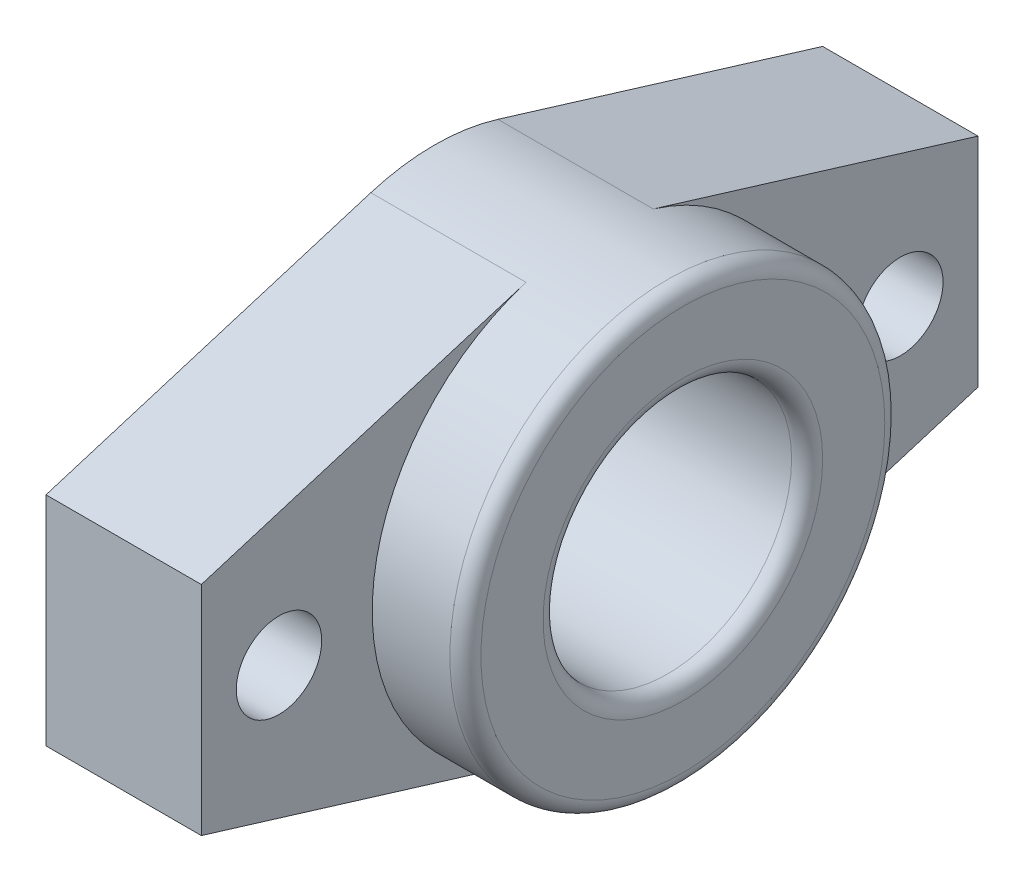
ISO-10303-21;
HEADER;
FILE_DESCRIPTION(('STEP AP214'),'2;1');
FILE_NAME('part.step','',(''),(''),'','','');
FILE_SCHEMA(('AUTOMOTIVE_DESIGN { 1 0 10303 214 1 1 1 1 }'));
ENDSEC;
DATA;
#1=APPLICATION_CONTEXT('core data for automotive mechanical design processes');
#2=APPLICATION_PROTOCOL_DEFINITION('international standard','automotive_design',2000,#1);
#3=PRODUCT_CONTEXT('',#1,'mechanical');
#4=PRODUCT('Part','Part','',(#3));
#5=PRODUCT_RELATED_PRODUCT_CATEGORY('part','',(#4));
#6=PRODUCT_DEFINITION_FORMATION('','',#4);
#7=PRODUCT_DEFINITION_CONTEXT('part definition',#1,'design');
#8=PRODUCT_DEFINITION('design','',#6,#7);
#9=PRODUCT_DEFINITION_SHAPE('','',#8);
#10=(LENGTH_UNIT() NAMED_UNIT(*) SI_UNIT(.MILLI.,.METRE.));
#11=(NAMED_UNIT(*) PLANE_ANGLE_UNIT() SI_UNIT($,.RADIAN.));
#12=(NAMED_UNIT(*) SI_UNIT($,.STERADIAN.) SOLID_ANGLE_UNIT());
#13=UNCERTAINTY_MEASURE_WITH_UNIT(LENGTH_MEASURE(1.E-05),#10,'distance_accuracy_value','');
#14=(GEOMETRIC_REPRESENTATION_CONTEXT(3) GLOBAL_UNCERTAINTY_ASSIGNED_CONTEXT((#13)) GLOBAL_UNIT_ASSIGNED_CONTEXT((#10,
#11,#12)) REPRESENTATION_CONTEXT('',''));
#15=CARTESIAN_POINT('',(0.,0.,0.));
#16=DIRECTION('',(0.,0.,1.));
#17=DIRECTION('',(1.,0.,0.));
#18=AXIS2_PLACEMENT_3D('',#15,#16,#17);
#19=CARTESIAN_POINT('',(10.,14.,-25.));
#20=DIRECTION('',(1.,0.,0.));
#21=DIRECTION('',(0.,0.,-1.));
#22=AXIS2_PLACEMENT_3D('',#19,#20,#21);
#23=PLANE('',#22);
#24=CARTESIAN_POINT('',(10.,14.,-5.));
#25=DIRECTION('',(1.,0.,0.));
#26=DIRECTION('',(0.,0.,-1.));
#27=AXIS2_PLACEMENT_3D('',#24,#25,#26);
#28=CIRCLE('',#27,2.75);
#29=CARTESIAN_POINT('',(10.,14.,-7.75));
#30=VERTEX_POINT('',#29);
#31=EDGE_CURVE('E260',#30,#30,#28,.T.);
#32=ORIENTED_EDGE('',*,*,#31,.F.);
#33=EDGE_LOOP('',(#32));
#34=FACE_BOUND('',#33,.T.);
#35=CARTESIAN_POINT('',(10.,14.,-25.));
#36=DIRECTION('',(1.,0.,0.));
#37=DIRECTION('',(0.,0.,-1.));
#38=AXIS2_PLACEMENT_3D('',#35,#36,#37);
#39=CIRCLE('',#38,14.);
#40=CARTESIAN_POINT('',(10.,27.3889078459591,-20.9088941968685));
#41=VERTEX_POINT('',#40);
#42=CARTESIAN_POINT('',(10.,0.61109215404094,-20.9088941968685));
#43=VERTEX_POINT('',#42);
#44=EDGE_CURVE('E63',#41,#43,#39,.T.);
#45=ORIENTED_EDGE('',*,*,#44,.F.);
#46=DIRECTION('',(0.,-0.292221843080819,0.956350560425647));
#47=VECTOR('',#46,1.);
#48=CARTESIAN_POINT('',(10.,21.,0.));
#49=LINE('',#48,#47);
#50=CARTESIAN_POINT('',(10.,21.,0.));
#51=VERTEX_POINT('',#50);
#52=EDGE_CURVE('E179',#41,#51,#49,.T.);
#53=ORIENTED_EDGE('',*,*,#52,.T.);
#54=DIRECTION('',(0.,-1.,0.));
#55=VECTOR('',#54,1.);
#56=CARTESIAN_POINT('',(10.,7.,0.));
#57=LINE('',#56,#55);
#58=CARTESIAN_POINT('',(10.,7.,0.));
#59=VERTEX_POINT('',#58);
#60=EDGE_CURVE('E109',#51,#59,#57,.T.);
#61=ORIENTED_EDGE('',*,*,#60,.T.);
#62=DIRECTION('',(0.,-0.292221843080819,-0.956350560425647));
#63=VECTOR('',#62,1.);
#64=CARTESIAN_POINT('',(10.,7.,0.));
#65=LINE('',#64,#63);
#66=EDGE_CURVE('E133',#59,#43,#65,.T.);
#67=ORIENTED_EDGE('',*,*,#66,.T.);
#68=EDGE_LOOP('',(#45,#53,#61,#67));
#69=FACE_BOUND('',#68,.T.);
#70=ADVANCED_FACE('F45',(#34,#69),#23,.T.);
#71=CARTESIAN_POINT('',(10.,21.,0.));
#72=DIRECTION('',(0.,-0.956350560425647,-0.292221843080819));
#73=DIRECTION('',(0.,0.292221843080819,-0.956350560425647));
#74=AXIS2_PLACEMENT_3D('',#71,#72,#73);
#75=PLANE('',#74);
#76=DIRECTION('',(0.,-0.292221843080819,0.956350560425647));
#77=VECTOR('',#76,1.);
#78=CARTESIAN_POINT('',(0.,21.,0.));
#79=LINE('',#78,#77);
#80=CARTESIAN_POINT('',(0.,27.3889078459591,-20.9088941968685));
#81=VERTEX_POINT('',#80);
#82=CARTESIAN_POINT('',(0.,21.,0.));
#83=VERTEX_POINT('',#82);
#84=EDGE_CURVE('E156',#81,#83,#79,.T.);
#85=ORIENTED_EDGE('',*,*,#84,.T.);
#86=DIRECTION('',(-1.,0.,0.));
#87=VECTOR('',#86,1.);
#88=CARTESIAN_POINT('',(10.,21.,0.));
#89=LINE('',#88,#87);
#90=EDGE_CURVE('E197',#51,#83,#89,.T.);
#91=ORIENTED_EDGE('',*,*,#90,.F.);
#92=ORIENTED_EDGE('',*,*,#52,.F.);
#93=DIRECTION('',(-1.,0.,0.));
#94=VECTOR('',#93,1.);
#95=CARTESIAN_POINT('',(10.,27.3889078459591,-20.9088941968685));
#96=LINE('',#95,#94);
#97=EDGE_CURVE('E152',#41,#81,#96,.T.);
#98=ORIENTED_EDGE('',*,*,#97,.T.);
#99=EDGE_LOOP('',(#85,#91,#92,#98));
#100=FACE_BOUND('',#99,.T.);
#101=ADVANCED_FACE('F233',(#100),#75,.F.);
#102=CARTESIAN_POINT('',(10.,7.,0.));
#103=DIRECTION('',(0.,0.,-1.));
#104=DIRECTION('',(-1.,0.,0.));
#105=AXIS2_PLACEMENT_3D('',#102,#103,#104);
#106=PLANE('',#105);
#107=DIRECTION('',(0.,-1.,0.));
#108=VECTOR('',#107,1.);
#109=CARTESIAN_POINT('',(0.,7.,0.));
#110=LINE('',#109,#108);
#111=CARTESIAN_POINT('',(0.,7.,0.));
#112=VERTEX_POINT('',#111);
#113=EDGE_CURVE('E160',#83,#112,#110,.T.);
#114=ORIENTED_EDGE('',*,*,#113,.T.);
#115=DIRECTION('',(-1.,0.,0.));
#116=VECTOR('',#115,1.);
#117=CARTESIAN_POINT('',(10.,7.,0.));
#118=LINE('',#117,#116);
#119=EDGE_CURVE('E193',#59,#112,#118,.T.);
#120=ORIENTED_EDGE('',*,*,#119,.F.);
#121=ORIENTED_EDGE('',*,*,#60,.F.);
#122=ORIENTED_EDGE('',*,*,#90,.T.);
#123=EDGE_LOOP('',(#114,#120,#121,#122));
#124=FACE_BOUND('',#123,.T.);
#125=ADVANCED_FACE('F241',(#124),#106,.F.);
#126=CARTESIAN_POINT('',(10.,7.,0.));
#127=DIRECTION('',(0.,0.956350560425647,-0.292221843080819));
#128=DIRECTION('',(0.,0.292221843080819,0.956350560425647));
#129=AXIS2_PLACEMENT_3D('',#126,#127,#128);
#130=PLANE('',#129);
#131=DIRECTION('',(0.,-0.292221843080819,-0.956350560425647));
#132=VECTOR('',#131,1.);
#133=CARTESIAN_POINT('',(0.,7.,0.));
#134=LINE('',#133,#132);
#135=CARTESIAN_POINT('',(0.,0.61109215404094,-20.9088941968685));
#136=VERTEX_POINT('',#135);
#137=EDGE_CURVE('E164',#112,#136,#134,.T.);
#138=ORIENTED_EDGE('',*,*,#137,.T.);
#139=DIRECTION('',(-1.,0.,0.));
#140=VECTOR('',#139,1.);
#141=CARTESIAN_POINT('',(10.,0.61109215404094,-20.9088941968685));
#142=LINE('',#141,#140);
#143=EDGE_CURVE('E189',#43,#136,#142,.T.);
#144=ORIENTED_EDGE('',*,*,#143,.F.);
#145=ORIENTED_EDGE('',*,*,#66,.F.);
#146=ORIENTED_EDGE('',*,*,#119,.T.);
#147=EDGE_LOOP('',(#138,#144,#145,#146));
#148=FACE_BOUND('',#147,.T.);
#149=ADVANCED_FACE('F277',(#148),#130,.F.);
#150=CARTESIAN_POINT('',(10.,7.,-50.));
#151=DIRECTION('',(0.,0.956350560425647,0.292221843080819));
#152=DIRECTION('',(0.,-0.292221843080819,0.956350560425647));
#153=AXIS2_PLACEMENT_3D('',#150,#151,#152);
#154=PLANE('',#153);
#155=DIRECTION('',(0.,0.292221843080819,-0.956350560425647));
#156=VECTOR('',#155,1.);
#157=CARTESIAN_POINT('',(0.,7.,-50.));
#158=LINE('',#157,#156);
#159=CARTESIAN_POINT('',(0.,0.611092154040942,-29.0911058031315));
#160=VERTEX_POINT('',#159);
#161=CARTESIAN_POINT('',(0.,7.,-50.));
#162=VERTEX_POINT('',#161);
#163=EDGE_CURVE('E139',#160,#162,#158,.T.);
#164=ORIENTED_EDGE('',*,*,#163,.T.);
#165=DIRECTION('',(-1.,0.,0.));
#166=VECTOR('',#165,1.);
#167=CARTESIAN_POINT('',(10.,7.,-50.));
#168=LINE('',#167,#166);
#169=CARTESIAN_POINT('',(10.,7.,-50.));
#170=VERTEX_POINT('',#169);
#171=EDGE_CURVE('E136',#170,#162,#168,.T.);
#172=ORIENTED_EDGE('',*,*,#171,.F.);
#173=DIRECTION('',(0.,0.292221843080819,-0.956350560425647));
#174=VECTOR('',#173,1.);
#175=CARTESIAN_POINT('',(10.,7.,-50.));
#176=LINE('',#175,#174);
#177=CARTESIAN_POINT('',(10.,0.611092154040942,-29.0911058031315));
#178=VERTEX_POINT('',#177);
#179=EDGE_CURVE('E120',#178,#170,#176,.T.);
#180=ORIENTED_EDGE('',*,*,#179,.F.);
#181=DIRECTION('',(-1.,0.,0.));
#182=VECTOR('',#181,1.);
#183=CARTESIAN_POINT('',(10.,0.611092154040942,-29.0911058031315));
#184=LINE('',#183,#182);
#185=EDGE_CURVE('E143',#178,#160,#184,.T.);
#186=ORIENTED_EDGE('',*,*,#185,.T.);
#187=EDGE_LOOP('',(#164,#172,#180,#186));
#188=FACE_BOUND('',#187,.T.);
#189=ADVANCED_FACE('F137',(#188),#154,.F.);
#190=CARTESIAN_POINT('',(10.,7.,-50.));
#191=DIRECTION('',(0.,0.,1.));
#192=DIRECTION('',(1.,0.,0.));
#193=AXIS2_PLACEMENT_3D('',#190,#191,#192);
#194=PLANE('',#193);
#195=DIRECTION('',(0.,1.,0.));
#196=VECTOR('',#195,1.);
#197=CARTESIAN_POINT('',(0.,7.,-50.));
#198=LINE('',#197,#196);
#199=CARTESIAN_POINT('',(0.,21.,-50.));
#200=VERTEX_POINT('',#199);
#201=EDGE_CURVE('E172',#162,#200,#198,.T.);
#202=ORIENTED_EDGE('',*,*,#201,.T.);
#203=DIRECTION('',(-1.,0.,0.));
#204=VECTOR('',#203,1.);
#205=CARTESIAN_POINT('',(10.,21.,-50.));
#206=LINE('',#205,#204);
#207=CARTESIAN_POINT('',(10.,21.,-50.));
#208=VERTEX_POINT('',#207);
#209=EDGE_CURVE('E144',#208,#200,#206,.T.);
#210=ORIENTED_EDGE('',*,*,#209,.F.);
#211=DIRECTION('',(0.,1.,0.));
#212=VECTOR('',#211,1.);
#213=CARTESIAN_POINT('',(10.,7.,-50.));
#214=LINE('',#213,#212);
#215=EDGE_CURVE('E125',#170,#208,#214,.T.);
#216=ORIENTED_EDGE('',*,*,#215,.F.);
#217=ORIENTED_EDGE('',*,*,#171,.T.);
#218=EDGE_LOOP('',(#202,#210,#216,#217));
#219=FACE_BOUND('',#218,.T.);
#220=ADVANCED_FACE('F146',(#219),#194,.F.);
#221=CARTESIAN_POINT('',(10.,21.,-50.));
#222=DIRECTION('',(0.,-0.956350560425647,0.292221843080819));
#223=DIRECTION('',(0.,-0.292221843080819,-0.956350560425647));
#224=AXIS2_PLACEMENT_3D('',#221,#222,#223);
#225=PLANE('',#224);
#226=DIRECTION('',(0.,0.292221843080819,0.956350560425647));
#227=VECTOR('',#226,1.);
#228=CARTESIAN_POINT('',(0.,21.,-50.));
#229=LINE('',#228,#227);
#230=CARTESIAN_POINT('',(0.,27.3889078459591,-29.0911058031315));
#231=VERTEX_POINT('',#230);
#232=EDGE_CURVE('E94',#200,#231,#229,.T.);
#233=ORIENTED_EDGE('',*,*,#232,.T.);
#234=DIRECTION('',(-1.,0.,0.));
#235=VECTOR('',#234,1.);
#236=CARTESIAN_POINT('',(10.,27.3889078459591,-29.0911058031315));
#237=LINE('',#236,#235);
#238=CARTESIAN_POINT('',(10.,27.3889078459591,-29.0911058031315));
#239=VERTEX_POINT('',#238);
#240=EDGE_CURVE('E182',#239,#231,#237,.T.);
#241=ORIENTED_EDGE('',*,*,#240,.F.);
#242=DIRECTION('',(0.,0.292221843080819,0.956350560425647));
#243=VECTOR('',#242,1.);
#244=CARTESIAN_POINT('',(10.,21.,-50.));
#245=LINE('',#244,#243);
#246=EDGE_CURVE('E149',#208,#239,#245,.T.);
#247=ORIENTED_EDGE('',*,*,#246,.F.);
#248=ORIENTED_EDGE('',*,*,#209,.T.);
#249=EDGE_LOOP('',(#233,#241,#247,#248));
#250=FACE_BOUND('',#249,.T.);
#251=ADVANCED_FACE('F253',(#250),#225,.F.);
#252=CARTESIAN_POINT('',(10.,14.,-25.));
#253=DIRECTION('',(-1.,0.,0.));
#254=DIRECTION('',(0.,0.,1.));
#255=AXIS2_PLACEMENT_3D('',#252,#253,#254);
#256=CYLINDRICAL_SURFACE('',#255,14.);
#257=CARTESIAN_POINT('',(15.,14.,-25.));
#258=DIRECTION('',(1.,0.,0.));
#259=DIRECTION('',(0.,0.,-1.));
#260=AXIS2_PLACEMENT_3D('',#257,#258,#259);
#261=CIRCLE('',#260,14.);
#262=CARTESIAN_POINT('',(15.,14.,-39.));
#263=VERTEX_POINT('',#262);
#264=EDGE_CURVE('E11',#263,#263,#261,.F.);
#265=ORIENTED_EDGE('',*,*,#264,.T.);
#266=EDGE_LOOP('',(#265));
#267=FACE_BOUND('',#266,.T.);
#268=CARTESIAN_POINT('',(0.,14.,-25.));
#269=DIRECTION('',(1.,0.,0.));
#270=DIRECTION('',(0.,0.,-1.));
#271=AXIS2_PLACEMENT_3D('',#268,#269,#270);
#272=CIRCLE('',#271,14.);
#273=EDGE_CURVE('E100',#231,#81,#272,.T.);
#274=ORIENTED_EDGE('',*,*,#273,.T.);
#275=ORIENTED_EDGE('',*,*,#97,.F.);
#276=ORIENTED_EDGE('',*,*,#44,.T.);
#277=ORIENTED_EDGE('',*,*,#143,.T.);
#278=CARTESIAN_POINT('',(0.,14.,-25.));
#279=DIRECTION('',(1.,0.,0.));
#280=DIRECTION('',(0.,0.,1.));
#281=AXIS2_PLACEMENT_3D('',#278,#279,#280);
#282=CIRCLE('',#281,14.);
#283=EDGE_CURVE('E167',#136,#160,#282,.T.);
#284=ORIENTED_EDGE('',*,*,#283,.T.);
#285=ORIENTED_EDGE('',*,*,#185,.F.);
#286=EDGE_CURVE('E128',#178,#239,#39,.T.);
#287=ORIENTED_EDGE('',*,*,#286,.T.);
#288=ORIENTED_EDGE('',*,*,#240,.T.);
#289=EDGE_LOOP('',(#274,#275,#276,#277,#284,#285,#287,#288));
#290=FACE_BOUND('',#289,.T.);
#291=ADVANCED_FACE('F246',(#267,#290),#256,.T.);
#292=CARTESIAN_POINT('',(10.,14.,-45.));
#293=DIRECTION('',(1.,0.,0.));
#294=DIRECTION('',(0.,0.,-1.));
#295=AXIS2_PLACEMENT_3D('',#292,#293,#294);
#296=CIRCLE('',#295,2.75);
#297=CARTESIAN_POINT('',(10.,14.,-47.75));
#298=VERTEX_POINT('',#297);
#299=EDGE_CURVE('E161',#298,#298,#296,.T.);
#300=ORIENTED_EDGE('',*,*,#299,.F.);
#301=EDGE_LOOP('',(#300));
#302=FACE_BOUND('',#301,.T.);
#303=ORIENTED_EDGE('',*,*,#286,.F.);
#304=ORIENTED_EDGE('',*,*,#179,.T.);
#305=ORIENTED_EDGE('',*,*,#215,.T.);
#306=ORIENTED_EDGE('',*,*,#246,.T.);
#307=EDGE_LOOP('',(#303,#304,#305,#306));
#308=FACE_BOUND('',#307,.T.);
#309=ADVANCED_FACE('F122',(#302,#308),#23,.T.);
#310=CARTESIAN_POINT('',(0.,14.,-25.));
#311=DIRECTION('',(1.,0.,0.));
#312=DIRECTION('',(0.,0.,-1.));
#313=AXIS2_PLACEMENT_3D('',#310,#311,#312);
#314=PLANE('',#313);
#315=CARTESIAN_POINT('',(0.,14.,-45.));
#316=DIRECTION('',(-1.,0.,0.));
#317=DIRECTION('',(0.,0.,1.));
#318=AXIS2_PLACEMENT_3D('',#315,#316,#317);
#319=CIRCLE('',#318,2.75);
#320=CARTESIAN_POINT('',(0.,14.,-42.25));
#321=VERTEX_POINT('',#320);
#322=EDGE_CURVE('E264',#321,#321,#319,.T.);
#323=ORIENTED_EDGE('',*,*,#322,.F.);
#324=EDGE_LOOP('',(#323));
#325=FACE_BOUND('',#324,.T.);
#326=CARTESIAN_POINT('',(0.,14.,-25.));
#327=DIRECTION('',(-1.,0.,0.));
#328=DIRECTION('',(0.,0.,1.));
#329=AXIS2_PLACEMENT_3D('',#326,#327,#328);
#330=CIRCLE('',#329,8.);
#331=CARTESIAN_POINT('',(0.,14.,-17.));
#332=VERTEX_POINT('',#331);
#333=EDGE_CURVE('E389',#332,#332,#330,.T.);
#334=ORIENTED_EDGE('',*,*,#333,.F.);
#335=EDGE_LOOP('',(#334));
#336=FACE_BOUND('',#335,.T.);
#337=CARTESIAN_POINT('',(0.,14.,-5.));
#338=DIRECTION('',(-1.,0.,0.));
#339=DIRECTION('',(0.,0.,1.));
#340=AXIS2_PLACEMENT_3D('',#337,#338,#339);
#341=CIRCLE('',#340,2.75);
#342=CARTESIAN_POINT('',(0.,14.,-2.25));
#343=VERTEX_POINT('',#342);
#344=EDGE_CURVE('E393',#343,#343,#341,.T.);
#345=ORIENTED_EDGE('',*,*,#344,.F.);
#346=EDGE_LOOP('',(#345));
#347=FACE_BOUND('',#346,.T.);
#348=ORIENTED_EDGE('',*,*,#84,.F.);
#349=ORIENTED_EDGE('',*,*,#273,.F.);
#350=ORIENTED_EDGE('',*,*,#232,.F.);
#351=ORIENTED_EDGE('',*,*,#201,.F.);
#352=ORIENTED_EDGE('',*,*,#163,.F.);
#353=ORIENTED_EDGE('',*,*,#283,.F.);
#354=ORIENTED_EDGE('',*,*,#137,.F.);
#355=ORIENTED_EDGE('',*,*,#113,.F.);
#356=EDGE_LOOP('',(#348,#349,#350,#351,#352,#353,#354,#355));
#357=FACE_BOUND('',#356,.T.);
#358=ADVANCED_FACE('F223',(#325,#336,#347,#357),#314,.F.);
#359=CARTESIAN_POINT('',(16.,14.,-25.));
#360=DIRECTION('',(1.,0.,0.));
#361=DIRECTION('',(0.,0.,-1.));
#362=AXIS2_PLACEMENT_3D('',#359,#360,#361);
#363=PLANE('',#362);
#364=CARTESIAN_POINT('',(16.,14.,-25.));
#365=DIRECTION('',(1.,0.,0.));
#366=DIRECTION('',(0.,0.,-1.));
#367=AXIS2_PLACEMENT_3D('',#364,#365,#366);
#368=CIRCLE('',#367,9.);
#369=CARTESIAN_POINT('',(16.,14.,-34.));
#370=VERTEX_POINT('',#369);
#371=EDGE_CURVE('E204',#370,#370,#368,.F.);
#372=ORIENTED_EDGE('',*,*,#371,.T.);
#373=EDGE_LOOP('',(#372));
#374=FACE_BOUND('',#373,.T.);
#375=CARTESIAN_POINT('',(16.,14.,-25.));
#376=DIRECTION('',(1.,0.,0.));
#377=DIRECTION('',(0.,0.,-1.));
#378=AXIS2_PLACEMENT_3D('',#375,#376,#377);
#379=CIRCLE('',#378,13.);
#380=CARTESIAN_POINT('',(16.,14.,-38.));
#381=VERTEX_POINT('',#380);
#382=EDGE_CURVE('E200',#381,#381,#379,.T.);
#383=ORIENTED_EDGE('',*,*,#382,.T.);
#384=EDGE_LOOP('',(#383));
#385=FACE_BOUND('',#384,.T.);
#386=ADVANCED_FACE('F220',(#374,#385),#363,.T.);
#387=CARTESIAN_POINT('',(16.,14.,-25.));
#388=DIRECTION('',(-1.,0.,0.));
#389=DIRECTION('',(0.,0.,1.));
#390=AXIS2_PLACEMENT_3D('',#387,#388,#389);
#391=CYLINDRICAL_SURFACE('',#390,8.);
#392=CARTESIAN_POINT('',(15.,14.,-25.));
#393=DIRECTION('',(1.,0.,0.));
#394=DIRECTION('',(0.,0.,-1.));
#395=AXIS2_PLACEMENT_3D('',#392,#393,#394);
#396=CIRCLE('',#395,8.);
#397=CARTESIAN_POINT('',(15.,14.,-33.));
#398=VERTEX_POINT('',#397);
#399=EDGE_CURVE('E55',#398,#398,#396,.T.);
#400=ORIENTED_EDGE('',*,*,#399,.T.);
#401=EDGE_LOOP('',(#400));
#402=FACE_BOUND('',#401,.T.);
#403=ORIENTED_EDGE('',*,*,#333,.T.);
#404=EDGE_LOOP('',(#403));
#405=FACE_BOUND('',#404,.T.);
#406=ADVANCED_FACE('F211',(#402,#405),#391,.F.);
#407=CARTESIAN_POINT('',(16.,14.,-5.));
#408=DIRECTION('',(-1.,0.,0.));
#409=DIRECTION('',(0.,0.,1.));
#410=AXIS2_PLACEMENT_3D('',#407,#408,#409);
#411=CYLINDRICAL_SURFACE('',#410,2.75);
#412=ORIENTED_EDGE('',*,*,#31,.T.);
#413=EDGE_LOOP('',(#412));
#414=FACE_BOUND('',#413,.T.);
#415=ORIENTED_EDGE('',*,*,#344,.T.);
#416=EDGE_LOOP('',(#415));
#417=FACE_BOUND('',#416,.T.);
#418=ADVANCED_FACE('F351',(#414,#417),#411,.F.);
#419=CARTESIAN_POINT('',(16.,14.,-45.));
#420=DIRECTION('',(-1.,0.,0.));
#421=DIRECTION('',(0.,0.,1.));
#422=AXIS2_PLACEMENT_3D('',#419,#420,#421);
#423=CYLINDRICAL_SURFACE('',#422,2.75);
#424=ORIENTED_EDGE('',*,*,#299,.T.);
#425=EDGE_LOOP('',(#424));
#426=FACE_BOUND('',#425,.T.);
#427=ORIENTED_EDGE('',*,*,#322,.T.);
#428=EDGE_LOOP('',(#427));
#429=FACE_BOUND('',#428,.T.);
#430=ADVANCED_FACE('F217',(#426,#429),#423,.F.);
#431=CARTESIAN_POINT('',(15.,14.,-25.));
#432=DIRECTION('',(1.,0.,0.));
#433=DIRECTION('',(0.,0.,-1.));
#434=AXIS2_PLACEMENT_3D('',#431,#432,#433);
#435=TOROIDAL_SURFACE('',#434,9.,1.);
#436=ORIENTED_EDGE('',*,*,#399,.F.);
#437=EDGE_LOOP('',(#436));
#438=FACE_BOUND('',#437,.T.);
#439=ORIENTED_EDGE('',*,*,#371,.F.);
#440=EDGE_LOOP('',(#439));
#441=FACE_BOUND('',#440,.T.);
#442=ADVANCED_FACE('F214',(#438,#441),#435,.T.);
#443=CARTESIAN_POINT('',(15.,14.,-25.));
#444=DIRECTION('',(1.,0.,0.));
#445=DIRECTION('',(0.,0.,-1.));
#446=AXIS2_PLACEMENT_3D('',#443,#444,#445);
#447=TOROIDAL_SURFACE('',#446,13.,1.);
#448=ORIENTED_EDGE('',*,*,#264,.F.);
#449=EDGE_LOOP('',(#448));
#450=FACE_BOUND('',#449,.T.);
#451=ORIENTED_EDGE('',*,*,#382,.F.);
#452=EDGE_LOOP('',(#451));
#453=FACE_BOUND('',#452,.T.);
#454=ADVANCED_FACE('F47',(#450,#453),#447,.T.);
#455=CLOSED_SHELL('',(#70,#101,#125,#149,#189,#220,#251,#291,#309,#358,#386,#406,#418,#430,#442,#454));
#456=MANIFOLD_SOLID_BREP('B2',#455);
#457=ADVANCED_BREP_SHAPE_REPRESENTATION('',(#18,#456),#14);
#458=SHAPE_DEFINITION_REPRESENTATION(#9,#457);
ENDSEC;
END-ISO-10303-21;
